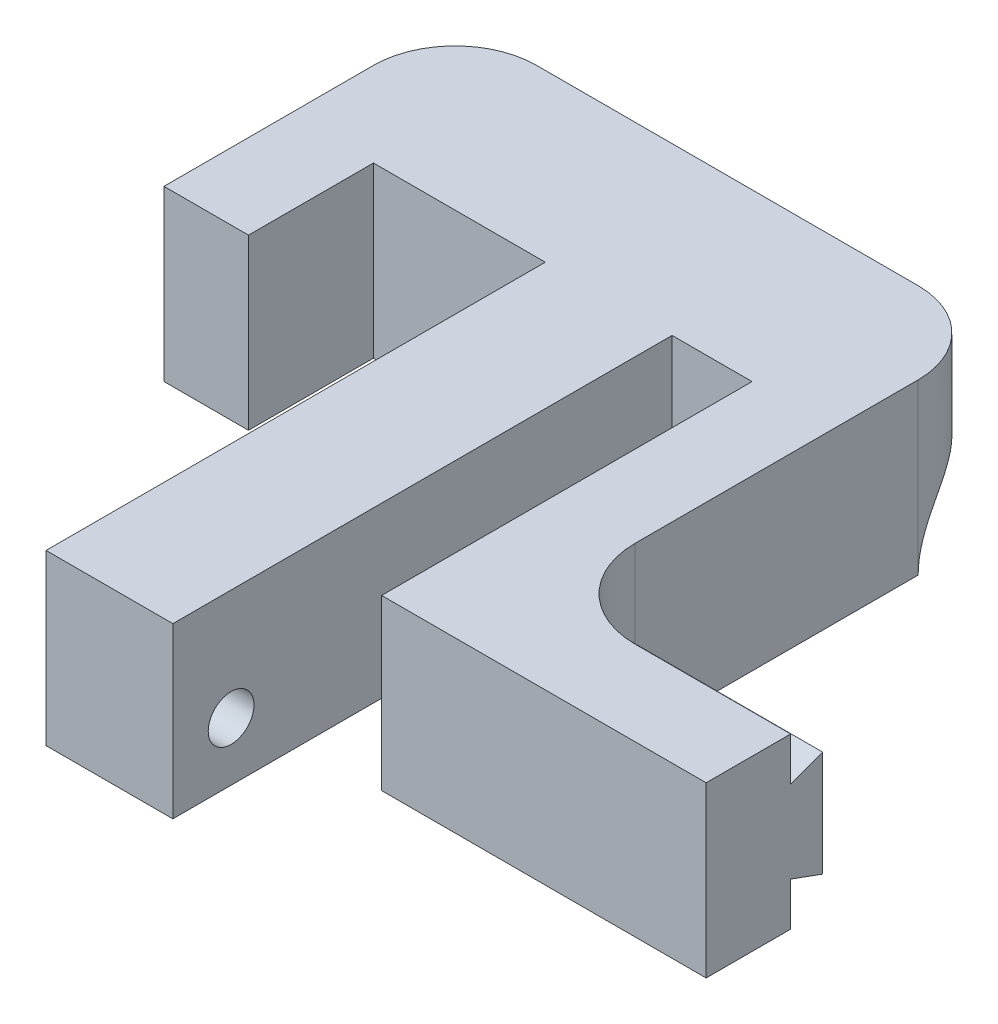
ISO-10303-21;
HEADER;
FILE_DESCRIPTION(('STEP AP214'),'2;1');
FILE_NAME('part.step','',(''),(''),'','','');
FILE_SCHEMA(('AUTOMOTIVE_DESIGN { 1 0 10303 214 1 1 1 1 }'));
ENDSEC;
DATA;
#1=APPLICATION_CONTEXT('core data for automotive mechanical design processes');
#2=APPLICATION_PROTOCOL_DEFINITION('international standard','automotive_design',2000,#1);
#3=PRODUCT_CONTEXT('',#1,'mechanical');
#4=PRODUCT('Part','Part','',(#3));
#5=PRODUCT_RELATED_PRODUCT_CATEGORY('part','',(#4));
#6=PRODUCT_DEFINITION_FORMATION('','',#4);
#7=PRODUCT_DEFINITION_CONTEXT('part definition',#1,'design');
#8=PRODUCT_DEFINITION('design','',#6,#7);
#9=PRODUCT_DEFINITION_SHAPE('','',#8);
#10=(LENGTH_UNIT() NAMED_UNIT(*) SI_UNIT(.MILLI.,.METRE.));
#11=(NAMED_UNIT(*) PLANE_ANGLE_UNIT() SI_UNIT($,.RADIAN.));
#12=(NAMED_UNIT(*) SI_UNIT($,.STERADIAN.) SOLID_ANGLE_UNIT());
#13=UNCERTAINTY_MEASURE_WITH_UNIT(LENGTH_MEASURE(1.E-05),#10,'distance_accuracy_value','');
#14=(GEOMETRIC_REPRESENTATION_CONTEXT(3) GLOBAL_UNCERTAINTY_ASSIGNED_CONTEXT((#13)) GLOBAL_UNIT_ASSIGNED_CONTEXT((#10,
#11,#12)) REPRESENTATION_CONTEXT('',''));
#15=CARTESIAN_POINT('',(0.,0.,0.));
#16=DIRECTION('',(0.,0.,1.));
#17=DIRECTION('',(1.,0.,0.));
#18=AXIS2_PLACEMENT_3D('',#15,#16,#17);
#19=CARTESIAN_POINT('',(60.205502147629,10.16,27.1612719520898));
#20=DIRECTION('',(0.,-1.,0.));
#21=DIRECTION('',(0.,0.,1.));
#22=AXIS2_PLACEMENT_3D('',#19,#20,#21);
#23=CYLINDRICAL_SURFACE('',#22,5.25779999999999);
#24=CARTESIAN_POINT('',(60.205502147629,9.46896879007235,27.1612719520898));
#25=DIRECTION('',(0.,0.939692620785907,0.342020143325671));
#26=DIRECTION('',(0.,-0.342020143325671,0.939692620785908));
#27=AXIS2_PLACEMENT_3D('',#24,#25,#26);
#28=ELLIPSE('',#27,5.59523389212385,5.25779999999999);
#29=CARTESIAN_POINT('',(60.205502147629,7.55528609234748,32.4190719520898));
#30=VERTEX_POINT('',#29);
#31=CARTESIAN_POINT('',(56.1410355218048,8.25500000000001,30.4966237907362));
#32=VERTEX_POINT('',#31);
#33=EDGE_CURVE('E257',#30,#32,#28,.F.);
#34=ORIENTED_EDGE('',*,*,#33,.T.);
#35=DIRECTION('',(0.,-1.,0.));
#36=VECTOR('',#35,1.);
#37=CARTESIAN_POINT('',(56.1410355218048,10.16,30.4966237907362));
#38=LINE('',#37,#36);
#39=CARTESIAN_POINT('',(56.1410355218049,1.90500000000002,30.4966237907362));
#40=VERTEX_POINT('',#39);
#41=EDGE_CURVE('E11',#40,#32,#38,.F.);
#42=ORIENTED_EDGE('',*,*,#41,.F.);
#43=CARTESIAN_POINT('',(60.205502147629,0.691031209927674,27.1612719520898));
#44=DIRECTION('',(0.,0.939692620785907,-0.342020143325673));
#45=DIRECTION('',(0.,-0.342020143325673,-0.939692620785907));
#46=AXIS2_PLACEMENT_3D('',#43,#44,#45);
#47=ELLIPSE('',#46,5.59523389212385,5.25779999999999);
#48=CARTESIAN_POINT('',(60.205502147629,2.60471390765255,32.4190719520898));
#49=VERTEX_POINT('',#48);
#50=EDGE_CURVE('E263',#49,#40,#47,.F.);
#51=ORIENTED_EDGE('',*,*,#50,.F.);
#52=DIRECTION('',(0.,-1.,0.));
#53=VECTOR('',#52,1.);
#54=CARTESIAN_POINT('',(60.205502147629,10.16,32.4190719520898));
#55=LINE('',#54,#53);
#56=CARTESIAN_POINT('',(60.205502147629,0.,32.4190719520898));
#57=VERTEX_POINT('',#56);
#58=EDGE_CURVE('E190',#49,#57,#55,.T.);
#59=ORIENTED_EDGE('',*,*,#58,.T.);
#60=CARTESIAN_POINT('',(60.205502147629,0.,27.1612719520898));
#61=DIRECTION('',(0.,1.,0.));
#62=DIRECTION('',(0.,0.,-1.));
#63=AXIS2_PLACEMENT_3D('',#60,#61,#62);
#64=CIRCLE('',#63,5.25779999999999);
#65=CARTESIAN_POINT('',(54.947702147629,0.,27.1612719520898));
#66=VERTEX_POINT('',#65);
#67=EDGE_CURVE('E185',#66,#57,#64,.T.);
#68=ORIENTED_EDGE('',*,*,#67,.F.);
#69=DIRECTION('',(0.,-1.,0.));
#70=VECTOR('',#69,1.);
#71=CARTESIAN_POINT('',(54.947702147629,10.16,27.1612719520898));
#72=LINE('',#71,#70);
#73=CARTESIAN_POINT('',(54.947702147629,10.16,27.1612719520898));
#74=VERTEX_POINT('',#73);
#75=EDGE_CURVE('E167',#74,#66,#72,.T.);
#76=ORIENTED_EDGE('',*,*,#75,.F.);
#77=CARTESIAN_POINT('',(60.205502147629,10.16,27.1612719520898));
#78=DIRECTION('',(0.,1.,0.));
#79=DIRECTION('',(0.,0.,-1.));
#80=AXIS2_PLACEMENT_3D('',#77,#78,#79);
#81=CIRCLE('',#80,5.25779999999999);
#82=CARTESIAN_POINT('',(60.205502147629,10.16,32.4190719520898));
#83=VERTEX_POINT('',#82);
#84=EDGE_CURVE('E172',#74,#83,#81,.T.);
#85=ORIENTED_EDGE('',*,*,#84,.T.);
#86=EDGE_CURVE('E186',#83,#30,#55,.T.);
#87=ORIENTED_EDGE('',*,*,#86,.T.);
#88=EDGE_LOOP('',(#34,#42,#51,#59,#68,#76,#85,#87));
#89=FACE_BOUND('',#88,.T.);
#90=ADVANCED_FACE('F37',(#89),#23,.F.);
#91=CARTESIAN_POINT('',(69.5455806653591,10.16,32.4190719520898));
#92=DIRECTION('',(0.,0.,1.));
#93=DIRECTION('',(-1.,0.,0.));
#94=AXIS2_PLACEMENT_3D('',#91,#92,#93);
#95=PLANE('',#94);
#96=DIRECTION('',(-1.,0.,0.));
#97=VECTOR('',#96,1.);
#98=CARTESIAN_POINT('',(69.5455806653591,7.55528609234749,32.4190719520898));
#99=LINE('',#98,#97);
#100=CARTESIAN_POINT('',(69.5455806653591,7.55528609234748,32.4190719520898));
#101=VERTEX_POINT('',#100);
#102=EDGE_CURVE('E45',#101,#30,#99,.T.);
#103=ORIENTED_EDGE('',*,*,#102,.T.);
#104=ORIENTED_EDGE('',*,*,#86,.F.);
#105=DIRECTION('',(1.,0.,0.));
#106=VECTOR('',#105,1.);
#107=CARTESIAN_POINT('',(69.5455806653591,10.16,32.4190719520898));
#108=LINE('',#107,#106);
#109=CARTESIAN_POINT('',(69.5455806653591,10.16,32.4190719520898));
#110=VERTEX_POINT('',#109);
#111=EDGE_CURVE('E178',#83,#110,#108,.T.);
#112=ORIENTED_EDGE('',*,*,#111,.T.);
#113=DIRECTION('',(0.,-1.,0.));
#114=VECTOR('',#113,1.);
#115=CARTESIAN_POINT('',(69.5455806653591,10.16,32.4190719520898));
#116=LINE('',#115,#114);
#117=EDGE_CURVE('E249',#110,#101,#116,.T.);
#118=ORIENTED_EDGE('',*,*,#117,.T.);
#119=EDGE_LOOP('',(#103,#104,#112,#118));
#120=FACE_BOUND('',#119,.T.);
#121=ADVANCED_FACE('F247',(#120),#95,.F.);
#122=CARTESIAN_POINT('',(33.7308148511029,3.5,18.74));
#123=DIRECTION('',(1.,0.,0.));
#124=DIRECTION('',(0.,0.,1.));
#125=AXIS2_PLACEMENT_3D('',#122,#123,#124);
#126=CYLINDRICAL_SURFACE('',#125,1.375);
#127=CARTESIAN_POINT('',(45.239902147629,3.5,18.74));
#128=DIRECTION('',(-1.,0.,0.));
#129=DIRECTION('',(0.,0.,1.));
#130=AXIS2_PLACEMENT_3D('',#127,#128,#129);
#131=CIRCLE('',#130,1.375);
#132=CARTESIAN_POINT('',(45.239902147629,3.5,20.115));
#133=VERTEX_POINT('',#132);
#134=EDGE_CURVE('E235',#133,#133,#131,.T.);
#135=ORIENTED_EDGE('',*,*,#134,.F.);
#136=EDGE_LOOP('',(#135));
#137=FACE_BOUND('',#136,.T.);
#138=CARTESIAN_POINT('',(40.159902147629,3.5,18.74));
#139=DIRECTION('',(1.,0.,0.));
#140=DIRECTION('',(0.,0.,-1.));
#141=AXIS2_PLACEMENT_3D('',#138,#139,#140);
#142=CIRCLE('',#141,1.375);
#143=CARTESIAN_POINT('',(40.159902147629,3.5,17.365));
#144=VERTEX_POINT('',#143);
#145=EDGE_CURVE('E237',#144,#144,#142,.F.);
#146=ORIENTED_EDGE('',*,*,#145,.T.);
#147=EDGE_LOOP('',(#146));
#148=FACE_BOUND('',#147,.T.);
#149=ADVANCED_FACE('F480',(#137,#148),#126,.F.);
#150=CARTESIAN_POINT('',(33.7308148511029,3.5,41.74));
#151=DIRECTION('',(1.,0.,0.));
#152=DIRECTION('',(0.,0.,1.));
#153=AXIS2_PLACEMENT_3D('',#150,#151,#152);
#154=CYLINDRICAL_SURFACE('',#153,1.37500000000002);
#155=CARTESIAN_POINT('',(45.239902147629,3.5,41.74));
#156=DIRECTION('',(-1.,0.,0.));
#157=DIRECTION('',(0.,0.,1.));
#158=AXIS2_PLACEMENT_3D('',#155,#156,#157);
#159=CIRCLE('',#158,1.37500000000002);
#160=CARTESIAN_POINT('',(45.239902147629,3.5,43.115));
#161=VERTEX_POINT('',#160);
#162=EDGE_CURVE('E319',#161,#161,#159,.T.);
#163=ORIENTED_EDGE('',*,*,#162,.F.);
#164=EDGE_LOOP('',(#163));
#165=FACE_BOUND('',#164,.T.);
#166=CARTESIAN_POINT('',(40.159902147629,3.5,41.74));
#167=DIRECTION('',(1.,0.,0.));
#168=DIRECTION('',(0.,0.,-1.));
#169=AXIS2_PLACEMENT_3D('',#166,#167,#168);
#170=CIRCLE('',#169,1.37500000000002);
#171=CARTESIAN_POINT('',(40.159902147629,3.5,40.365));
#172=VERTEX_POINT('',#171);
#173=EDGE_CURVE('E232',#172,#172,#170,.F.);
#174=ORIENTED_EDGE('',*,*,#173,.T.);
#175=EDGE_LOOP('',(#174));
#176=FACE_BOUND('',#175,.T.);
#177=ADVANCED_FACE('F489',(#165,#176),#154,.F.);
#178=CARTESIAN_POINT('',(69.5455806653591,10.16,37.4990719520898));
#179=DIRECTION('',(-1.,0.,0.));
#180=DIRECTION('',(0.,0.,-1.));
#181=AXIS2_PLACEMENT_3D('',#178,#179,#180);
#182=PLANE('',#181);
#183=DIRECTION('',(0.,0.,1.));
#184=VECTOR('',#183,1.);
#185=CARTESIAN_POINT('',(69.5455806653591,0.,37.4990719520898));
#186=LINE('',#185,#184);
#187=CARTESIAN_POINT('',(69.5455806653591,0.,32.4190719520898));
#188=VERTEX_POINT('',#187);
#189=CARTESIAN_POINT('',(69.5455806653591,0.,37.4990719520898));
#190=VERTEX_POINT('',#189);
#191=EDGE_CURVE('E322',#188,#190,#186,.T.);
#192=ORIENTED_EDGE('',*,*,#191,.F.);
#193=CARTESIAN_POINT('',(69.5455806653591,2.60471390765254,32.4190719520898));
#194=VERTEX_POINT('',#193);
#195=EDGE_CURVE('E360',#194,#188,#116,.T.);
#196=ORIENTED_EDGE('',*,*,#195,.F.);
#197=DIRECTION('',(0.,0.342020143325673,0.939692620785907));
#198=VECTOR('',#197,1.);
#199=CARTESIAN_POINT('',(69.545580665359,-8.1192686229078,2.95517210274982));
#200=LINE('',#199,#198);
#201=CARTESIAN_POINT('',(69.5455806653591,1.90500000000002,30.4966237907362));
#202=VERTEX_POINT('',#201);
#203=EDGE_CURVE('E457',#202,#194,#200,.T.);
#204=ORIENTED_EDGE('',*,*,#203,.F.);
#205=DIRECTION('',(0.,-1.,0.));
#206=VECTOR('',#205,1.);
#207=CARTESIAN_POINT('',(69.5455806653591,0.,30.4966237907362));
#208=LINE('',#207,#206);
#209=CARTESIAN_POINT('',(69.5455806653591,8.25500000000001,30.4966237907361));
#210=VERTEX_POINT('',#209);
#211=EDGE_CURVE('E462',#210,#202,#208,.T.);
#212=ORIENTED_EDGE('',*,*,#211,.F.);
#213=DIRECTION('',(0.,-0.342020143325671,0.939692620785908));
#214=VECTOR('',#213,1.);
#215=CARTESIAN_POINT('',(69.545580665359,17.0907743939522,6.22053315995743));
#216=LINE('',#215,#214);
#217=EDGE_CURVE('E460',#210,#101,#216,.T.);
#218=ORIENTED_EDGE('',*,*,#217,.T.);
#219=ORIENTED_EDGE('',*,*,#117,.F.);
#220=DIRECTION('',(0.,0.,1.));
#221=VECTOR('',#220,1.);
#222=CARTESIAN_POINT('',(69.5455806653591,10.16,37.4990719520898));
#223=LINE('',#222,#221);
#224=CARTESIAN_POINT('',(69.5455806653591,10.16,37.4990719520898));
#225=VERTEX_POINT('',#224);
#226=EDGE_CURVE('E61',#110,#225,#223,.T.);
#227=ORIENTED_EDGE('',*,*,#226,.T.);
#228=DIRECTION('',(0.,-1.,0.));
#229=VECTOR('',#228,1.);
#230=CARTESIAN_POINT('',(69.5455806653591,10.16,37.4990719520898));
#231=LINE('',#230,#229);
#232=EDGE_CURVE('E229',#225,#190,#231,.T.);
#233=ORIENTED_EDGE('',*,*,#232,.T.);
#234=EDGE_LOOP('',(#192,#196,#204,#212,#218,#219,#227,#233));
#235=FACE_BOUND('',#234,.T.);
#236=ADVANCED_FACE('F39',(#235),#182,.F.);
#237=CARTESIAN_POINT('',(50.045502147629,10.16,37.4990719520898));
#238=DIRECTION('',(0.,0.,-1.));
#239=DIRECTION('',(1.,0.,0.));
#240=AXIS2_PLACEMENT_3D('',#237,#238,#239);
#241=PLANE('',#240);
#242=DIRECTION('',(-1.,0.,0.));
#243=VECTOR('',#242,1.);
#244=CARTESIAN_POINT('',(50.045502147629,0.,37.4990719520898));
#245=LINE('',#244,#243);
#246=CARTESIAN_POINT('',(50.045502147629,0.,37.4990719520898));
#247=VERTEX_POINT('',#246);
#248=EDGE_CURVE('E362',#190,#247,#245,.T.);
#249=ORIENTED_EDGE('',*,*,#248,.F.);
#250=ORIENTED_EDGE('',*,*,#232,.F.);
#251=DIRECTION('',(-1.,0.,0.));
#252=VECTOR('',#251,1.);
#253=CARTESIAN_POINT('',(50.045502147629,10.16,37.4990719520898));
#254=LINE('',#253,#252);
#255=CARTESIAN_POINT('',(50.045502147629,10.16,37.4990719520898));
#256=VERTEX_POINT('',#255);
#257=EDGE_CURVE('E117',#225,#256,#254,.T.);
#258=ORIENTED_EDGE('',*,*,#257,.T.);
#259=DIRECTION('',(0.,-1.,0.));
#260=VECTOR('',#259,1.);
#261=CARTESIAN_POINT('',(50.045502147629,10.16,37.4990719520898));
#262=LINE('',#261,#260);
#263=EDGE_CURVE('E226',#256,#247,#262,.T.);
#264=ORIENTED_EDGE('',*,*,#263,.T.);
#265=EDGE_LOOP('',(#249,#250,#258,#264));
#266=FACE_BOUND('',#265,.T.);
#267=ADVANCED_FACE('F402',(#266),#241,.F.);
#268=CARTESIAN_POINT('',(50.045502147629,10.16,15.24));
#269=DIRECTION('',(1.,0.,0.));
#270=DIRECTION('',(0.,0.,1.));
#271=AXIS2_PLACEMENT_3D('',#268,#269,#270);
#272=PLANE('',#271);
#273=DIRECTION('',(0.,0.,-1.));
#274=VECTOR('',#273,1.);
#275=CARTESIAN_POINT('',(50.045502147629,0.,15.24));
#276=LINE('',#275,#274);
#277=CARTESIAN_POINT('',(50.045502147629,0.,15.24));
#278=VERTEX_POINT('',#277);
#279=EDGE_CURVE('E365',#247,#278,#276,.T.);
#280=ORIENTED_EDGE('',*,*,#279,.F.);
#281=ORIENTED_EDGE('',*,*,#263,.F.);
#282=DIRECTION('',(0.,0.,-1.));
#283=VECTOR('',#282,1.);
#284=CARTESIAN_POINT('',(50.045502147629,10.16,15.24));
#285=LINE('',#284,#283);
#286=CARTESIAN_POINT('',(50.045502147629,10.16,15.24));
#287=VERTEX_POINT('',#286);
#288=EDGE_CURVE('E325',#256,#287,#285,.T.);
#289=ORIENTED_EDGE('',*,*,#288,.T.);
#290=DIRECTION('',(0.,-1.,0.));
#291=VECTOR('',#290,1.);
#292=CARTESIAN_POINT('',(50.045502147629,10.16,15.24));
#293=LINE('',#292,#291);
#294=EDGE_CURVE('E223',#287,#278,#293,.T.);
#295=ORIENTED_EDGE('',*,*,#294,.T.);
#296=EDGE_LOOP('',(#280,#281,#289,#295));
#297=FACE_BOUND('',#296,.T.);
#298=ADVANCED_FACE('F405',(#297),#272,.F.);
#299=CARTESIAN_POINT('',(45.239902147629,10.16,15.24));
#300=DIRECTION('',(0.,0.,-1.));
#301=DIRECTION('',(1.,0.,0.));
#302=AXIS2_PLACEMENT_3D('',#299,#300,#301);
#303=PLANE('',#302);
#304=DIRECTION('',(-1.,0.,0.));
#305=VECTOR('',#304,1.);
#306=CARTESIAN_POINT('',(45.239902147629,0.,15.24));
#307=LINE('',#306,#305);
#308=CARTESIAN_POINT('',(45.239902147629,0.,15.24));
#309=VERTEX_POINT('',#308);
#310=EDGE_CURVE('E368',#278,#309,#307,.T.);
#311=ORIENTED_EDGE('',*,*,#310,.F.);
#312=ORIENTED_EDGE('',*,*,#294,.F.);
#313=DIRECTION('',(-1.,0.,0.));
#314=VECTOR('',#313,1.);
#315=CARTESIAN_POINT('',(45.239902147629,10.16,15.24));
#316=LINE('',#315,#314);
#317=CARTESIAN_POINT('',(45.239902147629,10.16,15.24));
#318=VERTEX_POINT('',#317);
#319=EDGE_CURVE('E328',#287,#318,#316,.T.);
#320=ORIENTED_EDGE('',*,*,#319,.T.);
#321=DIRECTION('',(0.,-1.,0.));
#322=VECTOR('',#321,1.);
#323=CARTESIAN_POINT('',(45.239902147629,10.16,15.24));
#324=LINE('',#323,#322);
#325=EDGE_CURVE('E220',#318,#309,#324,.T.);
#326=ORIENTED_EDGE('',*,*,#325,.T.);
#327=EDGE_LOOP('',(#311,#312,#320,#326));
#328=FACE_BOUND('',#327,.T.);
#329=ADVANCED_FACE('F408',(#328),#303,.F.);
#330=CARTESIAN_POINT('',(45.2399021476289,10.16,45.24));
#331=DIRECTION('',(-1.,0.,0.));
#332=DIRECTION('',(0.,0.,-1.));
#333=AXIS2_PLACEMENT_3D('',#330,#331,#332);
#334=PLANE('',#333);
#335=ORIENTED_EDGE('',*,*,#134,.T.);
#336=EDGE_LOOP('',(#335));
#337=FACE_BOUND('',#336,.T.);
#338=ORIENTED_EDGE('',*,*,#162,.T.);
#339=EDGE_LOOP('',(#338));
#340=FACE_BOUND('',#339,.T.);
#341=DIRECTION('',(0.,0.,1.));
#342=VECTOR('',#341,1.);
#343=CARTESIAN_POINT('',(45.2399021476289,0.,45.24));
#344=LINE('',#343,#342);
#345=CARTESIAN_POINT('',(45.2399021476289,0.,45.24));
#346=VERTEX_POINT('',#345);
#347=EDGE_CURVE('E371',#309,#346,#344,.T.);
#348=ORIENTED_EDGE('',*,*,#347,.F.);
#349=ORIENTED_EDGE('',*,*,#325,.F.);
#350=DIRECTION('',(0.,0.,1.));
#351=VECTOR('',#350,1.);
#352=CARTESIAN_POINT('',(45.2399021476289,10.16,45.24));
#353=LINE('',#352,#351);
#354=CARTESIAN_POINT('',(45.2399021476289,10.16,45.24));
#355=VERTEX_POINT('',#354);
#356=EDGE_CURVE('E331',#318,#355,#353,.T.);
#357=ORIENTED_EDGE('',*,*,#356,.T.);
#358=DIRECTION('',(0.,-1.,0.));
#359=VECTOR('',#358,1.);
#360=CARTESIAN_POINT('',(45.2399021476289,10.16,45.24));
#361=LINE('',#360,#359);
#362=EDGE_CURVE('E217',#355,#346,#361,.T.);
#363=ORIENTED_EDGE('',*,*,#362,.T.);
#364=EDGE_LOOP('',(#348,#349,#357,#363));
#365=FACE_BOUND('',#364,.T.);
#366=ADVANCED_FACE('F411',(#337,#340,#365),#334,.F.);
#367=CARTESIAN_POINT('',(37.6199021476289,10.16,45.24));
#368=DIRECTION('',(0.,0.,-1.));
#369=DIRECTION('',(1.,0.,0.));
#370=AXIS2_PLACEMENT_3D('',#367,#368,#369);
#371=PLANE('',#370);
#372=DIRECTION('',(-1.,0.,0.));
#373=VECTOR('',#372,1.);
#374=CARTESIAN_POINT('',(37.6199021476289,0.,45.24));
#375=LINE('',#374,#373);
#376=CARTESIAN_POINT('',(37.6199021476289,0.,45.24));
#377=VERTEX_POINT('',#376);
#378=EDGE_CURVE('E374',#346,#377,#375,.T.);
#379=ORIENTED_EDGE('',*,*,#378,.F.);
#380=ORIENTED_EDGE('',*,*,#362,.F.);
#381=DIRECTION('',(-1.,0.,0.));
#382=VECTOR('',#381,1.);
#383=CARTESIAN_POINT('',(37.6199021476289,10.16,45.24));
#384=LINE('',#383,#382);
#385=CARTESIAN_POINT('',(37.6199021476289,10.16,45.24));
#386=VERTEX_POINT('',#385);
#387=EDGE_CURVE('E334',#355,#386,#384,.T.);
#388=ORIENTED_EDGE('',*,*,#387,.T.);
#389=DIRECTION('',(0.,-1.,0.));
#390=VECTOR('',#389,1.);
#391=CARTESIAN_POINT('',(37.6199021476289,10.16,45.24));
#392=LINE('',#391,#390);
#393=EDGE_CURVE('E214',#386,#377,#392,.T.);
#394=ORIENTED_EDGE('',*,*,#393,.T.);
#395=EDGE_LOOP('',(#379,#380,#388,#394));
#396=FACE_BOUND('',#395,.T.);
#397=ADVANCED_FACE('F414',(#396),#371,.F.);
#398=CARTESIAN_POINT('',(37.619902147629,10.16,15.24));
#399=DIRECTION('',(1.,0.,0.));
#400=DIRECTION('',(0.,0.,1.));
#401=AXIS2_PLACEMENT_3D('',#398,#399,#400);
#402=PLANE('',#401);
#403=CARTESIAN_POINT('',(37.619902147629,3.5,18.74));
#404=DIRECTION('',(1.,0.,0.));
#405=DIRECTION('',(0.,0.,-1.));
#406=AXIS2_PLACEMENT_3D('',#403,#404,#405);
#407=CIRCLE('',#406,2.99999999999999);
#408=CARTESIAN_POINT('',(37.619902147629,3.5,15.74));
#409=VERTEX_POINT('',#408);
#410=EDGE_CURVE('E308',#409,#409,#407,.T.);
#411=ORIENTED_EDGE('',*,*,#410,.T.);
#412=EDGE_LOOP('',(#411));
#413=FACE_BOUND('',#412,.T.);
#414=CARTESIAN_POINT('',(37.619902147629,3.5,41.74));
#415=DIRECTION('',(1.,0.,0.));
#416=DIRECTION('',(0.,0.,-1.));
#417=AXIS2_PLACEMENT_3D('',#414,#415,#416);
#418=CIRCLE('',#417,2.99999999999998);
#419=CARTESIAN_POINT('',(37.619902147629,3.5,38.74));
#420=VERTEX_POINT('',#419);
#421=EDGE_CURVE('E240',#420,#420,#418,.T.);
#422=ORIENTED_EDGE('',*,*,#421,.T.);
#423=EDGE_LOOP('',(#422));
#424=FACE_BOUND('',#423,.T.);
#425=DIRECTION('',(0.,0.,-1.));
#426=VECTOR('',#425,1.);
#427=CARTESIAN_POINT('',(37.619902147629,0.,15.24));
#428=LINE('',#427,#426);
#429=CARTESIAN_POINT('',(37.619902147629,0.,15.24));
#430=VERTEX_POINT('',#429);
#431=EDGE_CURVE('E377',#377,#430,#428,.T.);
#432=ORIENTED_EDGE('',*,*,#431,.F.);
#433=ORIENTED_EDGE('',*,*,#393,.F.);
#434=DIRECTION('',(0.,0.,-1.));
#435=VECTOR('',#434,1.);
#436=CARTESIAN_POINT('',(37.619902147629,10.16,15.24));
#437=LINE('',#436,#435);
#438=CARTESIAN_POINT('',(37.619902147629,10.16,15.24));
#439=VERTEX_POINT('',#438);
#440=EDGE_CURVE('E337',#386,#439,#437,.T.);
#441=ORIENTED_EDGE('',*,*,#440,.T.);
#442=DIRECTION('',(0.,-1.,0.));
#443=VECTOR('',#442,1.);
#444=CARTESIAN_POINT('',(37.619902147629,10.16,15.24));
#445=LINE('',#444,#443);
#446=EDGE_CURVE('E211',#439,#430,#445,.T.);
#447=ORIENTED_EDGE('',*,*,#446,.T.);
#448=EDGE_LOOP('',(#432,#433,#441,#447));
#449=FACE_BOUND('',#448,.T.);
#450=ADVANCED_FACE('F417',(#413,#424,#449),#402,.F.);
#451=CARTESIAN_POINT('',(27.294802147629,10.16,15.24));
#452=DIRECTION('',(0.,0.,-1.));
#453=DIRECTION('',(1.,0.,0.));
#454=AXIS2_PLACEMENT_3D('',#451,#452,#453);
#455=PLANE('',#454);
#456=DIRECTION('',(-1.,0.,0.));
#457=VECTOR('',#456,1.);
#458=CARTESIAN_POINT('',(27.294802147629,0.,15.24));
#459=LINE('',#458,#457);
#460=CARTESIAN_POINT('',(27.294802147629,0.,15.24));
#461=VERTEX_POINT('',#460);
#462=EDGE_CURVE('E380',#430,#461,#459,.T.);
#463=ORIENTED_EDGE('',*,*,#462,.F.);
#464=ORIENTED_EDGE('',*,*,#446,.F.);
#465=DIRECTION('',(-1.,0.,0.));
#466=VECTOR('',#465,1.);
#467=CARTESIAN_POINT('',(27.294802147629,10.16,15.24));
#468=LINE('',#467,#466);
#469=CARTESIAN_POINT('',(27.294802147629,10.16,15.24));
#470=VERTEX_POINT('',#469);
#471=EDGE_CURVE('E340',#439,#470,#468,.T.);
#472=ORIENTED_EDGE('',*,*,#471,.T.);
#473=DIRECTION('',(0.,-1.,0.));
#474=VECTOR('',#473,1.);
#475=CARTESIAN_POINT('',(27.294802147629,10.16,15.24));
#476=LINE('',#475,#474);
#477=EDGE_CURVE('E208',#470,#461,#476,.T.);
#478=ORIENTED_EDGE('',*,*,#477,.T.);
#479=EDGE_LOOP('',(#463,#464,#472,#478));
#480=FACE_BOUND('',#479,.T.);
#481=ADVANCED_FACE('F420',(#480),#455,.F.);
#482=CARTESIAN_POINT('',(27.294802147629,10.16,22.7483017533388));
#483=DIRECTION('',(-1.,0.,0.));
#484=DIRECTION('',(0.,0.,-1.));
#485=AXIS2_PLACEMENT_3D('',#482,#483,#484);
#486=PLANE('',#485);
#487=DIRECTION('',(0.,0.,1.));
#488=VECTOR('',#487,1.);
#489=CARTESIAN_POINT('',(27.294802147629,0.,22.7483017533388));
#490=LINE('',#489,#488);
#491=CARTESIAN_POINT('',(27.294802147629,0.,22.7483017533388));
#492=VERTEX_POINT('',#491);
#493=EDGE_CURVE('E383',#461,#492,#490,.T.);
#494=ORIENTED_EDGE('',*,*,#493,.F.);
#495=ORIENTED_EDGE('',*,*,#477,.F.);
#496=DIRECTION('',(0.,0.,1.));
#497=VECTOR('',#496,1.);
#498=CARTESIAN_POINT('',(27.294802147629,10.16,22.7483017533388));
#499=LINE('',#498,#497);
#500=CARTESIAN_POINT('',(27.294802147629,10.16,22.7483017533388));
#501=VERTEX_POINT('',#500);
#502=EDGE_CURVE('E343',#470,#501,#499,.T.);
#503=ORIENTED_EDGE('',*,*,#502,.T.);
#504=DIRECTION('',(0.,-1.,0.));
#505=VECTOR('',#504,1.);
#506=CARTESIAN_POINT('',(27.294802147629,10.16,22.7483017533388));
#507=LINE('',#506,#505);
#508=EDGE_CURVE('E205',#501,#492,#507,.T.);
#509=ORIENTED_EDGE('',*,*,#508,.T.);
#510=EDGE_LOOP('',(#494,#495,#503,#509));
#511=FACE_BOUND('',#510,.T.);
#512=ADVANCED_FACE('F423',(#511),#486,.F.);
#513=CARTESIAN_POINT('',(22.214802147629,10.16,22.7483017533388));
#514=DIRECTION('',(0.,0.,-1.));
#515=DIRECTION('',(1.,0.,0.));
#516=AXIS2_PLACEMENT_3D('',#513,#514,#515);
#517=PLANE('',#516);
#518=DIRECTION('',(-1.,0.,0.));
#519=VECTOR('',#518,1.);
#520=CARTESIAN_POINT('',(22.214802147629,0.,22.7483017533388));
#521=LINE('',#520,#519);
#522=CARTESIAN_POINT('',(22.214802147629,0.,22.7483017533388));
#523=VERTEX_POINT('',#522);
#524=EDGE_CURVE('E386',#492,#523,#521,.T.);
#525=ORIENTED_EDGE('',*,*,#524,.F.);
#526=ORIENTED_EDGE('',*,*,#508,.F.);
#527=DIRECTION('',(-1.,0.,0.));
#528=VECTOR('',#527,1.);
#529=CARTESIAN_POINT('',(22.214802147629,10.16,22.7483017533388));
#530=LINE('',#529,#528);
#531=CARTESIAN_POINT('',(22.214802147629,10.16,22.7483017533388));
#532=VERTEX_POINT('',#531);
#533=EDGE_CURVE('E346',#501,#532,#530,.T.);
#534=ORIENTED_EDGE('',*,*,#533,.T.);
#535=DIRECTION('',(0.,-1.,0.));
#536=VECTOR('',#535,1.);
#537=CARTESIAN_POINT('',(22.214802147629,10.16,22.7483017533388));
#538=LINE('',#537,#536);
#539=EDGE_CURVE('E202',#532,#523,#538,.T.);
#540=ORIENTED_EDGE('',*,*,#539,.T.);
#541=EDGE_LOOP('',(#525,#526,#534,#540));
#542=FACE_BOUND('',#541,.T.);
#543=ADVANCED_FACE('F426',(#542),#517,.F.);
#544=CARTESIAN_POINT('',(22.214802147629,10.16,10.16));
#545=DIRECTION('',(1.,0.,0.));
#546=DIRECTION('',(0.,0.,1.));
#547=AXIS2_PLACEMENT_3D('',#544,#545,#546);
#548=PLANE('',#547);
#549=DIRECTION('',(0.,0.,-1.));
#550=VECTOR('',#549,1.);
#551=CARTESIAN_POINT('',(22.214802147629,0.,10.16));
#552=LINE('',#551,#550);
#553=CARTESIAN_POINT('',(22.214802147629,0.,10.16));
#554=VERTEX_POINT('',#553);
#555=EDGE_CURVE('E389',#523,#554,#552,.T.);
#556=ORIENTED_EDGE('',*,*,#555,.F.);
#557=ORIENTED_EDGE('',*,*,#539,.F.);
#558=DIRECTION('',(0.,0.,-1.));
#559=VECTOR('',#558,1.);
#560=CARTESIAN_POINT('',(22.214802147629,10.16,10.16));
#561=LINE('',#560,#559);
#562=CARTESIAN_POINT('',(22.214802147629,10.16,10.16));
#563=VERTEX_POINT('',#562);
#564=EDGE_CURVE('E349',#532,#563,#561,.T.);
#565=ORIENTED_EDGE('',*,*,#564,.T.);
#566=DIRECTION('',(0.,-1.,0.));
#567=VECTOR('',#566,1.);
#568=CARTESIAN_POINT('',(22.214802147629,10.16,10.16));
#569=LINE('',#568,#567);
#570=EDGE_CURVE('E199',#563,#554,#569,.T.);
#571=ORIENTED_EDGE('',*,*,#570,.T.);
#572=EDGE_LOOP('',(#556,#557,#565,#571));
#573=FACE_BOUND('',#572,.T.);
#574=ADVANCED_FACE('F299',(#573),#548,.F.);
#575=CARTESIAN_POINT('',(27.117002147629,10.16,10.16));
#576=DIRECTION('',(0.,-1.,0.));
#577=DIRECTION('',(0.,0.,1.));
#578=AXIS2_PLACEMENT_3D('',#575,#576,#577);
#579=CYLINDRICAL_SURFACE('',#578,4.90220000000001);
#580=ORIENTED_EDGE('',*,*,#570,.F.);
#581=CARTESIAN_POINT('',(27.117002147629,10.16,10.16));
#582=DIRECTION('',(0.,-1.,0.));
#583=DIRECTION('',(0.,0.,1.));
#584=AXIS2_PLACEMENT_3D('',#581,#582,#583);
#585=CIRCLE('',#584,4.90220000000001);
#586=CARTESIAN_POINT('',(27.117002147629,10.16,5.2578));
#587=VERTEX_POINT('',#586);
#588=EDGE_CURVE('E352',#563,#587,#585,.T.);
#589=ORIENTED_EDGE('',*,*,#588,.T.);
#590=DIRECTION('',(0.,-1.,0.));
#591=VECTOR('',#590,1.);
#592=CARTESIAN_POINT('',(27.117002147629,10.16,5.2578));
#593=LINE('',#592,#591);
#594=CARTESIAN_POINT('',(27.117002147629,5.07688754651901,5.25780000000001));
#595=VERTEX_POINT('',#594);
#596=EDGE_CURVE('E196',#587,#595,#593,.T.);
#597=ORIENTED_EDGE('',*,*,#596,.T.);
#598=CARTESIAN_POINT('',(22.214802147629,0.,10.16));
#599=CARTESIAN_POINT('',(22.2148474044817,0.141476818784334,10.1600147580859));
#600=CARTESIAN_POINT('',(22.2148035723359,0.282951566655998,10.1540904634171));
#601=CARTESIAN_POINT('',(22.2148647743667,0.564914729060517,10.1304699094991));
#602=CARTESIAN_POINT('',(22.2149698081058,0.705403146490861,10.1127736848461));
#603=CARTESIAN_POINT('',(22.2156564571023,0.984686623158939,10.0656691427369));
#604=CARTESIAN_POINT('',(22.2162390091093,1.12347780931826,10.0362378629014));
#605=CARTESIAN_POINT('',(22.2185199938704,1.39810469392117,9.96587683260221));
#606=CARTESIAN_POINT('',(22.2202184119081,1.53394043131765,9.92494723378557));
#607=CARTESIAN_POINT('',(22.2255766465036,1.80184382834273,9.8318305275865));
#608=CARTESIAN_POINT('',(22.2292388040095,1.93390679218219,9.77963002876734));
#609=CARTESIAN_POINT('',(22.2395745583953,2.19310130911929,9.66441026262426));
#610=CARTESIAN_POINT('',(22.2462479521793,2.32023319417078,9.60139172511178));
#611=CARTESIAN_POINT('',(22.2638137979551,2.56847018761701,9.46513280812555));
#612=CARTESIAN_POINT('',(22.2747028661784,2.68958004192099,9.39190065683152));
#613=CARTESIAN_POINT('',(22.3020372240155,2.92484744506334,9.23590921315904));
#614=CARTESIAN_POINT('',(22.3184821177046,3.03900548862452,9.15315059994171));
#615=CARTESIAN_POINT('',(22.3574734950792,3.25460334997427,8.98282106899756));
#616=CARTESIAN_POINT('',(22.379728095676,3.35637862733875,8.8956086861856));
#617=CARTESIAN_POINT('',(22.4318218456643,3.5517153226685,8.71448111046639));
#618=CARTESIAN_POINT('',(22.4616608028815,3.64527694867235,8.62056608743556));
#619=CARTESIAN_POINT('',(22.5299781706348,3.82324792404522,8.42759304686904));
#620=CARTESIAN_POINT('',(22.5684447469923,3.90766957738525,8.32854221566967));
#621=CARTESIAN_POINT('',(22.6549259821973,4.06684619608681,8.12690837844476));
#622=CARTESIAN_POINT('',(22.7029388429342,4.14160297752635,8.0243260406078));
#623=CARTESIAN_POINT('',(22.8014205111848,4.2710056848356,7.83250944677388));
#624=CARTESIAN_POINT('',(22.8505363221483,4.32699708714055,7.74348394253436));
#625=CARTESIAN_POINT('',(22.9563230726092,4.43158434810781,7.56557919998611));
#626=CARTESIAN_POINT('',(23.0129935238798,4.48018068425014,7.47669995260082));
#627=CARTESIAN_POINT('',(23.1338369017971,4.57012883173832,7.30038762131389));
#628=CARTESIAN_POINT('',(23.1980101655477,4.61148031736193,7.2129546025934));
#629=CARTESIAN_POINT('',(23.3336174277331,4.68728243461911,7.04077368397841));
#630=CARTESIAN_POINT('',(23.4050514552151,4.72173303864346,6.9560257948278));
#631=CARTESIAN_POINT('',(23.550099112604,4.78228884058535,6.79551958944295));
#632=CARTESIAN_POINT('',(23.6232972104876,4.80878115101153,6.71953051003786));
#633=CARTESIAN_POINT('',(23.7753401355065,4.85668218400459,6.57167030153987));
#634=CARTESIAN_POINT('',(23.8541867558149,4.87808928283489,6.49980049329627));
#635=CARTESIAN_POINT('',(24.0170344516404,4.91639149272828,6.360893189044));
#636=CARTESIAN_POINT('',(24.1010346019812,4.93328741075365,6.29385483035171));
#637=CARTESIAN_POINT('',(24.2737193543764,4.96318848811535,6.16513729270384));
#638=CARTESIAN_POINT('',(24.3624056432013,4.97619223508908,6.10346006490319));
#639=CARTESIAN_POINT('',(24.6516415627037,5.01240745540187,5.91626190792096));
#640=CARTESIAN_POINT('',(24.8602155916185,5.02945528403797,5.80169335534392));
#641=CARTESIAN_POINT('',(25.2922868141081,5.05390878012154,5.60384638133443));
#642=CARTESIAN_POINT('',(25.5157930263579,5.06130856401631,5.52058707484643));
#643=CARTESIAN_POINT('',(25.8554130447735,5.0686087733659,5.42149244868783));
#644=CARTESIAN_POINT('',(25.967924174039,5.070409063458,5.39296150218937));
#645=CARTESIAN_POINT('',(26.1947164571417,5.07319881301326,5.34394338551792));
#646=CARTESIAN_POINT('',(26.3089976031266,5.07418827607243,5.32345617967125));
#647=CARTESIAN_POINT('',(26.5386075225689,5.07565789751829,5.29066123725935));
#648=CARTESIAN_POINT('',(26.6539351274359,5.07613856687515,5.27834529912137));
#649=CARTESIAN_POINT('',(26.8851748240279,5.07674304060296,5.2619112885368));
#650=CARTESIAN_POINT('',(27.0010869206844,5.07686684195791,5.25779328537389));
#651=CARTESIAN_POINT('',(27.117002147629,5.07688754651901,5.2578));
#652=B_SPLINE_CURVE_WITH_KNOTS('',3,(#598,#599,#600,#601,#602,#603,#604,#605,#606,#607,#608,
#609,#610,#611,#612,#613,#614,#615,#616,#617,#618,#619,#620,#621,#622,#623,#624,#625,#626,#627,
#628,#629,#630,#631,#632,#633,#634,#635,#636,#637,#638,#639,#640,#641,#642,#643,#644,#645,#646,
#647,#648,#649,#650,#651),.UNSPECIFIED.,.F.,.F.,(4,2,2,2,2,2,2,2,2,2,2,2,2,2,2,2,2,2,2,2,2,2,2,
2,2,2,4),(0.,0.424303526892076,0.848605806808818,1.27374244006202,1.69887346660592,
2.12451241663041,2.55012266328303,2.97539199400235,3.40063102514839,3.80763525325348,
4.21462916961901,4.62106820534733,5.02743075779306,5.37518369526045,5.72291416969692,
6.07066027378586,6.41840776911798,6.74441266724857,7.07052152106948,7.3965720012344,
7.72274065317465,8.43541304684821,9.14851983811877,9.49653487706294,9.84454837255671,
10.1922120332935,10.5398786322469),.UNSPECIFIED.);
#653=EDGE_CURVE('E302',#554,#595,#652,.T.);
#654=ORIENTED_EDGE('',*,*,#653,.F.);
#655=EDGE_LOOP('',(#580,#589,#597,#654));
#656=FACE_BOUND('',#655,.T.);
#657=ADVANCED_FACE('F294',(#656),#579,.T.);
#658=CARTESIAN_POINT('',(50.045502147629,10.16,5.25779999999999));
#659=DIRECTION('',(0.,0.,1.));
#660=DIRECTION('',(-1.,0.,0.));
#661=AXIS2_PLACEMENT_3D('',#658,#659,#660);
#662=PLANE('',#661);
#663=ORIENTED_EDGE('',*,*,#596,.F.);
#664=DIRECTION('',(1.,0.,0.));
#665=VECTOR('',#664,1.);
#666=CARTESIAN_POINT('',(50.045502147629,10.16,5.25779999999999));
#667=LINE('',#666,#665);
#668=CARTESIAN_POINT('',(50.045502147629,10.16,5.25779999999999));
#669=VERTEX_POINT('',#668);
#670=EDGE_CURVE('E355',#587,#669,#667,.T.);
#671=ORIENTED_EDGE('',*,*,#670,.T.);
#672=DIRECTION('',(0.,-1.,0.));
#673=VECTOR('',#672,1.);
#674=CARTESIAN_POINT('',(50.045502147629,10.16,5.25779999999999));
#675=LINE('',#674,#673);
#676=CARTESIAN_POINT('',(50.045502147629,5.07688754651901,5.25779999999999));
#677=VERTEX_POINT('',#676);
#678=EDGE_CURVE('E188',#669,#677,#675,.T.);
#679=ORIENTED_EDGE('',*,*,#678,.T.);
#680=DIRECTION('',(-1.,0.,0.));
#681=VECTOR('',#680,1.);
#682=CARTESIAN_POINT('',(62.1319070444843,5.07688754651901,5.25779999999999));
#683=LINE('',#682,#681);
#684=EDGE_CURVE('E278',#595,#677,#683,.F.);
#685=ORIENTED_EDGE('',*,*,#684,.F.);
#686=EDGE_LOOP('',(#663,#671,#679,#685));
#687=FACE_BOUND('',#686,.T.);
#688=ADVANCED_FACE('F289',(#687),#662,.F.);
#689=CARTESIAN_POINT('',(50.045502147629,10.16,10.16));
#690=DIRECTION('',(0.,-1.,0.));
#691=DIRECTION('',(0.,0.,1.));
#692=AXIS2_PLACEMENT_3D('',#689,#690,#691);
#693=CYLINDRICAL_SURFACE('',#692,4.90220000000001);
#694=ORIENTED_EDGE('',*,*,#678,.F.);
#695=CARTESIAN_POINT('',(50.045502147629,10.16,10.16));
#696=DIRECTION('',(0.,-1.,0.));
#697=DIRECTION('',(0.,0.,1.));
#698=AXIS2_PLACEMENT_3D('',#695,#696,#697);
#699=CIRCLE('',#698,4.90220000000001);
#700=CARTESIAN_POINT('',(54.947702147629,10.16,10.16));
#701=VERTEX_POINT('',#700);
#702=EDGE_CURVE('E173',#669,#701,#699,.T.);
#703=ORIENTED_EDGE('',*,*,#702,.T.);
#704=DIRECTION('',(0.,-1.,0.));
#705=VECTOR('',#704,1.);
#706=CARTESIAN_POINT('',(54.947702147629,10.16,10.16));
#707=LINE('',#706,#705);
#708=CARTESIAN_POINT('',(54.947702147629,0.,10.16));
#709=VERTEX_POINT('',#708);
#710=EDGE_CURVE('E170',#701,#709,#707,.T.);
#711=ORIENTED_EDGE('',*,*,#710,.T.);
#712=CARTESIAN_POINT('',(50.045502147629,5.07688754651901,5.25779999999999));
#713=CARTESIAN_POINT('',(50.1814954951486,5.07684785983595,5.25778579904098));
#714=CARTESIAN_POINT('',(50.3174876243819,5.07668809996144,5.26345836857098));
#715=CARTESIAN_POINT('',(50.5885322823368,5.07584180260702,5.28607547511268));
#716=CARTESIAN_POINT('',(50.7235847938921,5.07515525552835,5.30302021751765));
#717=CARTESIAN_POINT('',(50.9920590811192,5.07296668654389,5.34812226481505));
#718=CARTESIAN_POINT('',(51.1254773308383,5.07146314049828,5.37630049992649));
#719=CARTESIAN_POINT('',(51.3894820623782,5.0670795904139,5.44366260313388));
#720=CARTESIAN_POINT('',(51.5200685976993,5.06419961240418,5.48284626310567));
#721=CARTESIAN_POINT('',(51.7776331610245,5.05631800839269,5.57198505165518));
#722=CARTESIAN_POINT('',(51.904606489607,5.05131374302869,5.62195354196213));
#723=CARTESIAN_POINT('',(52.1538162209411,5.03826126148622,5.73223079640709));
#724=CARTESIAN_POINT('',(52.276052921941,5.03021323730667,5.79253890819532));
#725=CARTESIAN_POINT('',(52.5147307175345,5.0100150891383,5.92290802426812));
#726=CARTESIAN_POINT('',(52.6311766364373,4.99786844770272,5.9929607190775));
#727=CARTESIAN_POINT('',(52.8573995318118,4.96830199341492,6.14214604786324));
#728=CARTESIAN_POINT('',(52.967176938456,4.95088252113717,6.22127809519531));
#729=CARTESIAN_POINT('',(53.1748527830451,4.91037836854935,6.38435999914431));
#730=CARTESIAN_POINT('',(53.2730505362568,4.88754771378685,6.46799124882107));
#731=CARTESIAN_POINT('',(53.4615656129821,4.83484778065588,6.64169108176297));
#732=CARTESIAN_POINT('',(53.5518831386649,4.80497868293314,6.73175949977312));
#733=CARTESIAN_POINT('',(53.7237927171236,4.73728725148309,6.9169022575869));
#734=CARTESIAN_POINT('',(53.8053943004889,4.69947374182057,7.01197095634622));
#735=CARTESIAN_POINT('',(53.95938966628,4.61511346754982,7.20562255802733));
#736=CARTESIAN_POINT('',(54.0317848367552,4.56856802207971,7.30420492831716));
#737=CARTESIAN_POINT('',(54.1584555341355,4.47274222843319,7.49050200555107));
#738=CARTESIAN_POINT('',(54.2138646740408,4.42455519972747,7.57801148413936));
#739=CARTESIAN_POINT('',(54.3173664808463,4.32101629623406,7.75311791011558));
#740=CARTESIAN_POINT('',(54.3654594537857,4.26566472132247,7.84071485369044));
#741=CARTESIAN_POINT('',(54.4544771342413,4.14784739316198,8.01475825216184));
#742=CARTESIAN_POINT('',(54.495401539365,4.08538133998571,8.1012046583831));
#743=CARTESIAN_POINT('',(54.5704154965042,3.95355669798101,8.27177169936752));
#744=CARTESIAN_POINT('',(54.6045049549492,3.88419801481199,8.35589230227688));
#745=CARTESIAN_POINT('',(54.6649479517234,3.74222448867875,8.51702837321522));
#746=CARTESIAN_POINT('',(54.6915808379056,3.66989715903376,8.59419320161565));
#747=CARTESIAN_POINT('',(54.7396064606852,3.51965621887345,8.74465922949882));
#748=CARTESIAN_POINT('',(54.76099750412,3.4417408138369,8.8179591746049));
#749=CARTESIAN_POINT('',(54.7991247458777,3.28080160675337,8.95998171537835));
#750=CARTESIAN_POINT('',(54.8158616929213,3.19777862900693,9.02870504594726));
#751=CARTESIAN_POINT('',(54.8453227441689,3.02705170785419,9.16105754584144));
#752=CARTESIAN_POINT('',(54.8580453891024,2.93934607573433,9.22468485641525));
#753=CARTESIAN_POINT('',(54.8812919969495,2.75010174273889,9.35291093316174));
#754=CARTESIAN_POINT('',(54.8914330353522,2.64808906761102,9.4168800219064));
#755=CARTESIAN_POINT('',(54.9084041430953,2.4395303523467,9.53753460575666));
#756=CARTESIAN_POINT('',(54.9152327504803,2.33298233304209,9.59421687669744));
#757=CARTESIAN_POINT('',(54.9263546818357,2.11595894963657,9.69992355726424));
#758=CARTESIAN_POINT('',(54.9306466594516,2.00548153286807,9.74894389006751));
#759=CARTESIAN_POINT('',(54.9373897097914,1.78126322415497,9.8390020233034));
#760=CARTESIAN_POINT('',(54.9398406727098,1.66752213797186,9.88003934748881));
#761=CARTESIAN_POINT('',(54.9436694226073,1.4272500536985,9.95715538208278));
#762=CARTESIAN_POINT('',(54.9449337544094,1.30047452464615,9.99247965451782));
#763=CARTESIAN_POINT('',(54.9466318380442,1.04455275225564,10.0531891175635));
#764=CARTESIAN_POINT('',(54.9470655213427,0.91540631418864,10.0785734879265));
#765=CARTESIAN_POINT('',(54.9475772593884,0.655607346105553,10.1192308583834));
#766=CARTESIAN_POINT('',(54.9476555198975,0.524955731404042,10.1345097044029));
#767=CARTESIAN_POINT('',(54.9477010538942,0.262869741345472,10.1548995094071));
#768=CARTESIAN_POINT('',(54.9476683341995,0.131435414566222,10.1600110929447));
#769=CARTESIAN_POINT('',(54.947702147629,0.,10.16));
#770=B_SPLINE_CURVE_WITH_KNOTS('',3,(#712,#713,#714,#715,#716,#717,#718,#719,#720,#721,#722,
#723,#724,#725,#726,#727,#728,#729,#730,#731,#732,#733,#734,#735,#736,#737,#738,#739,#740,#741,
#742,#743,#744,#745,#746,#747,#748,#749,#750,#751,#752,#753,#754,#755,#756,#757,#758,#759,#760,
#761,#762,#763,#764,#765,#766,#767,#768,#769),.UNSPECIFIED.,.F.,.F.,(4,2,2,2,2,2,2,2,2,2,2,2,2,
2,2,2,2,2,2,2,2,2,2,2,2,2,2,2,4),(0.,0.407860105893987,0.815727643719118,1.22435869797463,
1.63298202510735,2.04211454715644,2.45122126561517,2.85998124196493,3.26871482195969,
3.66112534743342,4.05352580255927,4.44549269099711,4.83740041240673,5.1796637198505,
5.52191270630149,5.86417612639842,6.20644423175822,6.53329100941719,6.86024322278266,
7.18714280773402,7.51416108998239,7.87630335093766,8.23860529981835,8.60109937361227,
8.96361506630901,9.35804067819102,9.75249883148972,10.1467285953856,10.5409341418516),.UNSPECIFIED.);
#771=EDGE_CURVE('E265',#677,#709,#770,.T.);
#772=ORIENTED_EDGE('',*,*,#771,.F.);
#773=EDGE_LOOP('',(#694,#703,#711,#772));
#774=FACE_BOUND('',#773,.T.);
#775=ADVANCED_FACE('F284',(#774),#693,.T.);
#776=CARTESIAN_POINT('',(54.947702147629,10.16,27.1612719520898));
#777=DIRECTION('',(-1.,0.,0.));
#778=DIRECTION('',(0.,0.,-1.));
#779=AXIS2_PLACEMENT_3D('',#776,#777,#778);
#780=PLANE('',#779);
#781=DIRECTION('',(0.,0.,1.));
#782=VECTOR('',#781,1.);
#783=CARTESIAN_POINT('',(54.947702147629,0.,27.1612719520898));
#784=LINE('',#783,#782);
#785=EDGE_CURVE('E392',#709,#66,#784,.T.);
#786=ORIENTED_EDGE('',*,*,#785,.F.);
#787=ORIENTED_EDGE('',*,*,#710,.F.);
#788=DIRECTION('',(0.,0.,1.));
#789=VECTOR('',#788,1.);
#790=CARTESIAN_POINT('',(54.947702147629,10.16,27.1612719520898));
#791=LINE('',#790,#789);
#792=EDGE_CURVE('E162',#701,#74,#791,.T.);
#793=ORIENTED_EDGE('',*,*,#792,.T.);
#794=ORIENTED_EDGE('',*,*,#75,.T.);
#795=EDGE_LOOP('',(#786,#787,#793,#794));
#796=FACE_BOUND('',#795,.T.);
#797=ADVANCED_FACE('F165',(#796),#780,.F.);
#798=ORIENTED_EDGE('',*,*,#195,.T.);
#799=DIRECTION('',(1.,0.,0.));
#800=VECTOR('',#799,1.);
#801=CARTESIAN_POINT('',(69.5455806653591,0.,32.4190719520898));
#802=LINE('',#801,#800);
#803=EDGE_CURVE('E112',#57,#188,#802,.T.);
#804=ORIENTED_EDGE('',*,*,#803,.F.);
#805=ORIENTED_EDGE('',*,*,#58,.F.);
#806=DIRECTION('',(-1.,0.,0.));
#807=VECTOR('',#806,1.);
#808=CARTESIAN_POINT('',(69.5455806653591,2.60471390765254,32.4190719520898));
#809=LINE('',#808,#807);
#810=EDGE_CURVE('E52',#194,#49,#809,.T.);
#811=ORIENTED_EDGE('',*,*,#810,.F.);
#812=EDGE_LOOP('',(#798,#804,#805,#811));
#813=FACE_BOUND('',#812,.T.);
#814=ADVANCED_FACE('F397',(#813),#95,.F.);
#815=CARTESIAN_POINT('',(60.205502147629,10.16,27.1612719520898));
#816=DIRECTION('',(0.,1.,0.));
#817=DIRECTION('',(0.,0.,-1.));
#818=AXIS2_PLACEMENT_3D('',#815,#816,#817);
#819=PLANE('',#818);
#820=ORIENTED_EDGE('',*,*,#226,.F.);
#821=ORIENTED_EDGE('',*,*,#111,.F.);
#822=ORIENTED_EDGE('',*,*,#84,.F.);
#823=ORIENTED_EDGE('',*,*,#792,.F.);
#824=ORIENTED_EDGE('',*,*,#702,.F.);
#825=ORIENTED_EDGE('',*,*,#670,.F.);
#826=ORIENTED_EDGE('',*,*,#588,.F.);
#827=ORIENTED_EDGE('',*,*,#564,.F.);
#828=ORIENTED_EDGE('',*,*,#533,.F.);
#829=ORIENTED_EDGE('',*,*,#502,.F.);
#830=ORIENTED_EDGE('',*,*,#471,.F.);
#831=ORIENTED_EDGE('',*,*,#440,.F.);
#832=ORIENTED_EDGE('',*,*,#387,.F.);
#833=ORIENTED_EDGE('',*,*,#356,.F.);
#834=ORIENTED_EDGE('',*,*,#319,.F.);
#835=ORIENTED_EDGE('',*,*,#288,.F.);
#836=ORIENTED_EDGE('',*,*,#257,.F.);
#837=EDGE_LOOP('',(#820,#821,#822,#823,#824,#825,#826,#827,#828,#829,#830,#831,#832,#833,#834,
#835,#836));
#838=FACE_BOUND('',#837,.T.);
#839=ADVANCED_FACE('F176',(#838),#819,.T.);
#840=CARTESIAN_POINT('',(60.205502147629,0.,27.1612719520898));
#841=DIRECTION('',(0.,1.,0.));
#842=DIRECTION('',(0.,0.,-1.));
#843=AXIS2_PLACEMENT_3D('',#840,#841,#842);
#844=PLANE('',#843);
#845=ORIENTED_EDGE('',*,*,#785,.T.);
#846=ORIENTED_EDGE('',*,*,#67,.T.);
#847=ORIENTED_EDGE('',*,*,#803,.T.);
#848=ORIENTED_EDGE('',*,*,#191,.T.);
#849=ORIENTED_EDGE('',*,*,#248,.T.);
#850=ORIENTED_EDGE('',*,*,#279,.T.);
#851=ORIENTED_EDGE('',*,*,#310,.T.);
#852=ORIENTED_EDGE('',*,*,#347,.T.);
#853=ORIENTED_EDGE('',*,*,#378,.T.);
#854=ORIENTED_EDGE('',*,*,#431,.T.);
#855=ORIENTED_EDGE('',*,*,#462,.T.);
#856=ORIENTED_EDGE('',*,*,#493,.T.);
#857=ORIENTED_EDGE('',*,*,#524,.T.);
#858=ORIENTED_EDGE('',*,*,#555,.T.);
#859=DIRECTION('',(-1.,0.,0.));
#860=VECTOR('',#859,1.);
#861=CARTESIAN_POINT('',(62.1319070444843,0.,10.16));
#862=LINE('',#861,#860);
#863=EDGE_CURVE('E262',#709,#554,#862,.T.);
#864=ORIENTED_EDGE('',*,*,#863,.F.);
#865=EDGE_LOOP('',(#845,#846,#847,#848,#849,#850,#851,#852,#853,#854,#855,#856,#857,#858,#864));
#866=FACE_BOUND('',#865,.T.);
#867=ADVANCED_FACE('F400',(#866),#844,.F.);
#868=CARTESIAN_POINT('',(40.159902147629,3.5,41.74));
#869=DIRECTION('',(-1.,0.,0.));
#870=DIRECTION('',(0.,0.,-1.));
#871=AXIS2_PLACEMENT_3D('',#868,#869,#870);
#872=PLANE('',#871);
#873=CARTESIAN_POINT('',(40.159902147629,3.5,41.74));
#874=DIRECTION('',(1.,0.,0.));
#875=DIRECTION('',(0.,0.,-1.));
#876=AXIS2_PLACEMENT_3D('',#873,#874,#875);
#877=CIRCLE('',#876,2.99999999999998);
#878=CARTESIAN_POINT('',(40.159902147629,3.5,38.74));
#879=VERTEX_POINT('',#878);
#880=EDGE_CURVE('E236',#879,#879,#877,.T.);
#881=ORIENTED_EDGE('',*,*,#880,.F.);
#882=EDGE_LOOP('',(#881));
#883=FACE_BOUND('',#882,.T.);
#884=ORIENTED_EDGE('',*,*,#173,.F.);
#885=EDGE_LOOP('',(#884));
#886=FACE_BOUND('',#885,.T.);
#887=ADVANCED_FACE('F486',(#883,#886),#872,.T.);
#888=CARTESIAN_POINT('',(40.159902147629,3.5,41.74));
#889=DIRECTION('',(-1.,0.,0.));
#890=DIRECTION('',(0.,0.,-1.));
#891=AXIS2_PLACEMENT_3D('',#888,#889,#890);
#892=CYLINDRICAL_SURFACE('',#891,2.99999999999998);
#893=ORIENTED_EDGE('',*,*,#880,.T.);
#894=EDGE_LOOP('',(#893));
#895=FACE_BOUND('',#894,.T.);
#896=ORIENTED_EDGE('',*,*,#421,.F.);
#897=EDGE_LOOP('',(#896));
#898=FACE_BOUND('',#897,.T.);
#899=ADVANCED_FACE('F496',(#895,#898),#892,.F.);
#900=CARTESIAN_POINT('',(40.159902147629,3.5,18.74));
#901=DIRECTION('',(-1.,0.,0.));
#902=DIRECTION('',(0.,0.,-1.));
#903=AXIS2_PLACEMENT_3D('',#900,#901,#902);
#904=PLANE('',#903);
#905=CARTESIAN_POINT('',(40.159902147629,3.5,18.74));
#906=DIRECTION('',(1.,0.,0.));
#907=DIRECTION('',(0.,0.,-1.));
#908=AXIS2_PLACEMENT_3D('',#905,#906,#907);
#909=CIRCLE('',#908,2.99999999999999);
#910=CARTESIAN_POINT('',(40.159902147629,3.5,15.74));
#911=VERTEX_POINT('',#910);
#912=EDGE_CURVE('E241',#911,#911,#909,.T.);
#913=ORIENTED_EDGE('',*,*,#912,.F.);
#914=EDGE_LOOP('',(#913));
#915=FACE_BOUND('',#914,.T.);
#916=ORIENTED_EDGE('',*,*,#145,.F.);
#917=EDGE_LOOP('',(#916));
#918=FACE_BOUND('',#917,.T.);
#919=ADVANCED_FACE('F499',(#915,#918),#904,.T.);
#920=CARTESIAN_POINT('',(40.159902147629,3.5,18.74));
#921=DIRECTION('',(-1.,0.,0.));
#922=DIRECTION('',(0.,0.,-1.));
#923=AXIS2_PLACEMENT_3D('',#920,#921,#922);
#924=CYLINDRICAL_SURFACE('',#923,2.99999999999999);
#925=ORIENTED_EDGE('',*,*,#912,.T.);
#926=EDGE_LOOP('',(#925));
#927=FACE_BOUND('',#926,.T.);
#928=ORIENTED_EDGE('',*,*,#410,.F.);
#929=EDGE_LOOP('',(#928));
#930=FACE_BOUND('',#929,.T.);
#931=ADVANCED_FACE('F474',(#927,#930),#924,.F.);
#932=CARTESIAN_POINT('',(62.1319070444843,0.,5.08));
#933=DIRECTION('',(-1.,0.,0.));
#934=DIRECTION('',(0.,0.,-1.));
#935=AXIS2_PLACEMENT_3D('',#932,#933,#934);
#936=CYLINDRICAL_SURFACE('',#935,5.07999999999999);
#937=ORIENTED_EDGE('',*,*,#863,.T.);
#938=ORIENTED_EDGE('',*,*,#653,.T.);
#939=ORIENTED_EDGE('',*,*,#684,.T.);
#940=ORIENTED_EDGE('',*,*,#771,.T.);
#941=EDGE_LOOP('',(#937,#938,#939,#940));
#942=FACE_BOUND('',#941,.T.);
#943=ADVANCED_FACE('F280',(#942),#936,.F.);
#944=CARTESIAN_POINT('',(43.4108727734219,0.,30.4966237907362));
#945=DIRECTION('',(0.,0.,-1.));
#946=DIRECTION('',(1.,0.,0.));
#947=AXIS2_PLACEMENT_3D('',#944,#945,#946);
#948=PLANE('',#947);
#949=ORIENTED_EDGE('',*,*,#41,.T.);
#950=DIRECTION('',(1.,0.,0.));
#951=VECTOR('',#950,1.);
#952=CARTESIAN_POINT('',(43.4108727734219,8.25500000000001,30.4966237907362));
#953=LINE('',#952,#951);
#954=EDGE_CURVE('E261',#32,#210,#953,.T.);
#955=ORIENTED_EDGE('',*,*,#954,.T.);
#956=ORIENTED_EDGE('',*,*,#211,.T.);
#957=DIRECTION('',(1.,0.,0.));
#958=VECTOR('',#957,1.);
#959=CARTESIAN_POINT('',(43.4108727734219,1.90500000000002,30.4966237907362));
#960=LINE('',#959,#958);
#961=EDGE_CURVE('E454',#40,#202,#960,.T.);
#962=ORIENTED_EDGE('',*,*,#961,.F.);
#963=EDGE_LOOP('',(#949,#955,#956,#962));
#964=FACE_BOUND('',#963,.T.);
#965=ADVANCED_FACE('F463',(#964),#948,.T.);
#966=CARTESIAN_POINT('',(43.4108727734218,17.0907743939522,6.2205331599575));
#967=DIRECTION('',(0.,-0.939692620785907,-0.342020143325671));
#968=DIRECTION('',(0.,-0.342020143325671,0.939692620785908));
#969=AXIS2_PLACEMENT_3D('',#966,#967,#968);
#970=PLANE('',#969);
#971=ORIENTED_EDGE('',*,*,#102,.F.);
#972=ORIENTED_EDGE('',*,*,#217,.F.);
#973=ORIENTED_EDGE('',*,*,#954,.F.);
#974=ORIENTED_EDGE('',*,*,#33,.F.);
#975=EDGE_LOOP('',(#971,#972,#973,#974));
#976=FACE_BOUND('',#975,.T.);
#977=ADVANCED_FACE('F259',(#976),#970,.F.);
#978=CARTESIAN_POINT('',(43.4108727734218,-8.1192686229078,2.95517210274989));
#979=DIRECTION('',(0.,-0.939692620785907,0.342020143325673));
#980=DIRECTION('',(0.,0.342020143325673,0.939692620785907));
#981=AXIS2_PLACEMENT_3D('',#978,#979,#980);
#982=PLANE('',#981);
#983=ORIENTED_EDGE('',*,*,#50,.T.);
#984=ORIENTED_EDGE('',*,*,#961,.T.);
#985=ORIENTED_EDGE('',*,*,#203,.T.);
#986=ORIENTED_EDGE('',*,*,#810,.T.);
#987=EDGE_LOOP('',(#983,#984,#985,#986));
#988=FACE_BOUND('',#987,.T.);
#989=ADVANCED_FACE('F456',(#988),#982,.T.);
#990=CLOSED_SHELL('',(#90,#121,#149,#177,#236,#267,#298,#329,#366,#397,#450,#481,#512,#543,#574,
#657,#688,#775,#797,#814,#839,#867,#887,#899,#919,#931,#943,#965,#977,#989));
#991=MANIFOLD_SOLID_BREP('B2',#990);
#992=ADVANCED_BREP_SHAPE_REPRESENTATION('',(#18,#991),#14);
#993=SHAPE_DEFINITION_REPRESENTATION(#9,#992);
ENDSEC;
END-ISO-10303-21;
